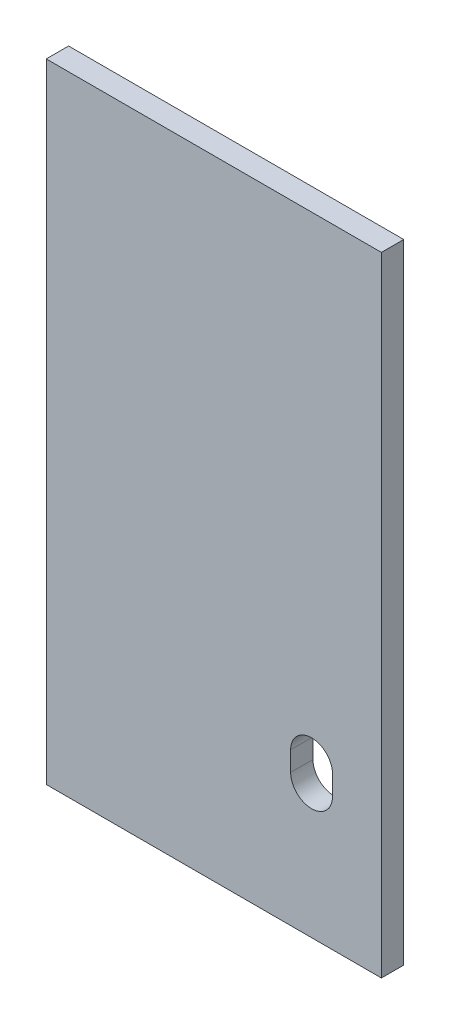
ISO-10303-21;
HEADER;
FILE_DESCRIPTION(('STEP AP214'),'2;1');
FILE_NAME('part.step','',(''),(''),'','','');
FILE_SCHEMA(('AUTOMOTIVE_DESIGN { 1 0 10303 214 1 1 1 1 }'));
ENDSEC;
DATA;
#1=APPLICATION_CONTEXT('core data for automotive mechanical design processes');
#2=APPLICATION_PROTOCOL_DEFINITION('international standard','automotive_design',2000,#1);
#3=PRODUCT_CONTEXT('',#1,'mechanical');
#4=PRODUCT('Part','Part','',(#3));
#5=PRODUCT_RELATED_PRODUCT_CATEGORY('part','',(#4));
#6=PRODUCT_DEFINITION_FORMATION('','',#4);
#7=PRODUCT_DEFINITION_CONTEXT('part definition',#1,'design');
#8=PRODUCT_DEFINITION('design','',#6,#7);
#9=PRODUCT_DEFINITION_SHAPE('','',#8);
#10=(LENGTH_UNIT() NAMED_UNIT(*) SI_UNIT(.MILLI.,.METRE.));
#11=(NAMED_UNIT(*) PLANE_ANGLE_UNIT() SI_UNIT($,.RADIAN.));
#12=(NAMED_UNIT(*) SI_UNIT($,.STERADIAN.) SOLID_ANGLE_UNIT());
#13=UNCERTAINTY_MEASURE_WITH_UNIT(LENGTH_MEASURE(1.E-05),#10,'distance_accuracy_value','');
#14=(GEOMETRIC_REPRESENTATION_CONTEXT(3) GLOBAL_UNCERTAINTY_ASSIGNED_CONTEXT((#13)) GLOBAL_UNIT_ASSIGNED_CONTEXT((#10,
#11,#12)) REPRESENTATION_CONTEXT('',''));
#15=CARTESIAN_POINT('',(0.,0.,0.));
#16=DIRECTION('',(0.,0.,1.));
#17=DIRECTION('',(1.,0.,0.));
#18=AXIS2_PLACEMENT_3D('',#15,#16,#17);
#19=CARTESIAN_POINT('',(0.,225.,8.));
#20=DIRECTION('',(0.,0.,-1.));
#21=DIRECTION('',(-1.,0.,0.));
#22=AXIS2_PLACEMENT_3D('',#19,#20,#21);
#23=PLANE('',#22);
#24=DIRECTION('',(0.,-1.,0.));
#25=VECTOR('',#24,1.);
#26=CARTESIAN_POINT('',(0.,0.,8.));
#27=LINE('',#26,#25);
#28=CARTESIAN_POINT('',(0.,225.,8.));
#29=VERTEX_POINT('',#28);
#30=CARTESIAN_POINT('',(0.,0.,8.));
#31=VERTEX_POINT('',#30);
#32=EDGE_CURVE('E136',#29,#31,#27,.T.);
#33=ORIENTED_EDGE('',*,*,#32,.T.);
#34=DIRECTION('',(1.,0.,0.));
#35=VECTOR('',#34,1.);
#36=CARTESIAN_POINT('',(0.,0.,8.));
#37=LINE('',#36,#35);
#38=CARTESIAN_POINT('',(120.,0.,8.));
#39=VERTEX_POINT('',#38);
#40=EDGE_CURVE('E139',#31,#39,#37,.T.);
#41=ORIENTED_EDGE('',*,*,#40,.T.);
#42=DIRECTION('',(0.,1.,0.));
#43=VECTOR('',#42,1.);
#44=CARTESIAN_POINT('',(120.,0.,8.));
#45=LINE('',#44,#43);
#46=CARTESIAN_POINT('',(120.,225.,8.));
#47=VERTEX_POINT('',#46);
#48=EDGE_CURVE('E142',#39,#47,#45,.T.);
#49=ORIENTED_EDGE('',*,*,#48,.T.);
#50=DIRECTION('',(-1.,0.,0.));
#51=VECTOR('',#50,1.);
#52=CARTESIAN_POINT('',(0.,225.,8.));
#53=LINE('',#52,#51);
#54=EDGE_CURVE('E144',#47,#29,#53,.T.);
#55=ORIENTED_EDGE('',*,*,#54,.T.);
#56=EDGE_LOOP('',(#33,#41,#49,#55));
#57=FACE_BOUND('',#56,.T.);
#58=CARTESIAN_POINT('',(95.,54.5,8.));
#59=DIRECTION('',(0.,0.,1.));
#60=DIRECTION('',(1.,0.,0.));
#61=AXIS2_PLACEMENT_3D('',#58,#59,#60);
#62=CIRCLE('',#61,7.5);
#63=CARTESIAN_POINT('',(102.5,54.5,8.));
#64=VERTEX_POINT('',#63);
#65=CARTESIAN_POINT('',(87.5,54.5,8.));
#66=VERTEX_POINT('',#65);
#67=EDGE_CURVE('E100',#64,#66,#62,.T.);
#68=ORIENTED_EDGE('',*,*,#67,.F.);
#69=DIRECTION('',(0.,1.,0.));
#70=VECTOR('',#69,1.);
#71=CARTESIAN_POINT('',(102.5,54.5,8.));
#72=LINE('',#71,#70);
#73=CARTESIAN_POINT('',(102.5,47.5,8.));
#74=VERTEX_POINT('',#73);
#75=EDGE_CURVE('E122',#74,#64,#72,.T.);
#76=ORIENTED_EDGE('',*,*,#75,.F.);
#77=CARTESIAN_POINT('',(95.,47.5,8.));
#78=DIRECTION('',(0.,0.,1.));
#79=DIRECTION('',(1.,0.,0.));
#80=AXIS2_PLACEMENT_3D('',#77,#78,#79);
#81=CIRCLE('',#80,7.5);
#82=CARTESIAN_POINT('',(87.5,47.5,8.));
#83=VERTEX_POINT('',#82);
#84=EDGE_CURVE('E120',#83,#74,#81,.T.);
#85=ORIENTED_EDGE('',*,*,#84,.F.);
#86=DIRECTION('',(0.,-1.,0.));
#87=VECTOR('',#86,1.);
#88=CARTESIAN_POINT('',(87.5,54.5,8.));
#89=LINE('',#88,#87);
#90=EDGE_CURVE('E108',#66,#83,#89,.T.);
#91=ORIENTED_EDGE('',*,*,#90,.F.);
#92=EDGE_LOOP('',(#68,#76,#85,#91));
#93=FACE_BOUND('',#92,.T.);
#94=ADVANCED_FACE('F35',(#57,#93),#23,.F.);
#95=CARTESIAN_POINT('',(0.,225.,0.));
#96=DIRECTION('',(0.,0.,-1.));
#97=DIRECTION('',(-1.,0.,0.));
#98=AXIS2_PLACEMENT_3D('',#95,#96,#97);
#99=PLANE('',#98);
#100=DIRECTION('',(0.,-1.,0.));
#101=VECTOR('',#100,1.);
#102=CARTESIAN_POINT('',(0.,0.,0.));
#103=LINE('',#102,#101);
#104=CARTESIAN_POINT('',(0.,225.,0.));
#105=VERTEX_POINT('',#104);
#106=CARTESIAN_POINT('',(0.,0.,0.));
#107=VERTEX_POINT('',#106);
#108=EDGE_CURVE('E116',#105,#107,#103,.T.);
#109=ORIENTED_EDGE('',*,*,#108,.F.);
#110=DIRECTION('',(-1.,0.,0.));
#111=VECTOR('',#110,1.);
#112=CARTESIAN_POINT('',(0.,225.,0.));
#113=LINE('',#112,#111);
#114=CARTESIAN_POINT('',(120.,225.,0.));
#115=VERTEX_POINT('',#114);
#116=EDGE_CURVE('E140',#115,#105,#113,.T.);
#117=ORIENTED_EDGE('',*,*,#116,.F.);
#118=DIRECTION('',(0.,1.,0.));
#119=VECTOR('',#118,1.);
#120=CARTESIAN_POINT('',(120.,0.,0.));
#121=LINE('',#120,#119);
#122=CARTESIAN_POINT('',(120.,0.,0.));
#123=VERTEX_POINT('',#122);
#124=EDGE_CURVE('E151',#123,#115,#121,.T.);
#125=ORIENTED_EDGE('',*,*,#124,.F.);
#126=DIRECTION('',(1.,0.,0.));
#127=VECTOR('',#126,1.);
#128=CARTESIAN_POINT('',(0.,0.,0.));
#129=LINE('',#128,#127);
#130=EDGE_CURVE('E149',#107,#123,#129,.T.);
#131=ORIENTED_EDGE('',*,*,#130,.F.);
#132=EDGE_LOOP('',(#109,#117,#125,#131));
#133=FACE_BOUND('',#132,.T.);
#134=DIRECTION('',(0.,1.,0.));
#135=VECTOR('',#134,1.);
#136=CARTESIAN_POINT('',(102.5,54.5,0.));
#137=LINE('',#136,#135);
#138=CARTESIAN_POINT('',(102.5,47.5,0.));
#139=VERTEX_POINT('',#138);
#140=CARTESIAN_POINT('',(102.5,54.5,0.));
#141=VERTEX_POINT('',#140);
#142=EDGE_CURVE('E109',#139,#141,#137,.T.);
#143=ORIENTED_EDGE('',*,*,#142,.T.);
#144=CARTESIAN_POINT('',(95.,54.5,0.));
#145=DIRECTION('',(0.,0.,1.));
#146=DIRECTION('',(1.,0.,0.));
#147=AXIS2_PLACEMENT_3D('',#144,#145,#146);
#148=CIRCLE('',#147,7.5);
#149=CARTESIAN_POINT('',(87.5,54.5,0.));
#150=VERTEX_POINT('',#149);
#151=EDGE_CURVE('E58',#141,#150,#148,.T.);
#152=ORIENTED_EDGE('',*,*,#151,.T.);
#153=DIRECTION('',(0.,-1.,0.));
#154=VECTOR('',#153,1.);
#155=CARTESIAN_POINT('',(87.5,54.5,0.));
#156=LINE('',#155,#154);
#157=CARTESIAN_POINT('',(87.5,47.5,0.));
#158=VERTEX_POINT('',#157);
#159=EDGE_CURVE('E115',#150,#158,#156,.T.);
#160=ORIENTED_EDGE('',*,*,#159,.T.);
#161=CARTESIAN_POINT('',(95.,47.5,0.));
#162=DIRECTION('',(0.,0.,1.));
#163=DIRECTION('',(1.,0.,0.));
#164=AXIS2_PLACEMENT_3D('',#161,#162,#163);
#165=CIRCLE('',#164,7.5);
#166=EDGE_CURVE('E128',#158,#139,#165,.T.);
#167=ORIENTED_EDGE('',*,*,#166,.T.);
#168=EDGE_LOOP('',(#143,#152,#160,#167));
#169=FACE_BOUND('',#168,.T.);
#170=ADVANCED_FACE('F169',(#133,#169),#99,.T.);
#171=CARTESIAN_POINT('',(0.,0.,8.));
#172=DIRECTION('',(1.,0.,0.));
#173=DIRECTION('',(0.,0.,-1.));
#174=AXIS2_PLACEMENT_3D('',#171,#172,#173);
#175=PLANE('',#174);
#176=ORIENTED_EDGE('',*,*,#108,.T.);
#177=DIRECTION('',(0.,0.,-1.));
#178=VECTOR('',#177,1.);
#179=CARTESIAN_POINT('',(0.,0.,8.));
#180=LINE('',#179,#178);
#181=EDGE_CURVE('E11',#31,#107,#180,.T.);
#182=ORIENTED_EDGE('',*,*,#181,.F.);
#183=ORIENTED_EDGE('',*,*,#32,.F.);
#184=DIRECTION('',(0.,0.,-1.));
#185=VECTOR('',#184,1.);
#186=CARTESIAN_POINT('',(0.,225.,8.));
#187=LINE('',#186,#185);
#188=EDGE_CURVE('E146',#29,#105,#187,.T.);
#189=ORIENTED_EDGE('',*,*,#188,.T.);
#190=EDGE_LOOP('',(#176,#182,#183,#189));
#191=FACE_BOUND('',#190,.T.);
#192=ADVANCED_FACE('F37',(#191),#175,.F.);
#193=CARTESIAN_POINT('',(0.,0.,8.));
#194=DIRECTION('',(0.,1.,0.));
#195=DIRECTION('',(0.,0.,1.));
#196=AXIS2_PLACEMENT_3D('',#193,#194,#195);
#197=PLANE('',#196);
#198=ORIENTED_EDGE('',*,*,#130,.T.);
#199=DIRECTION('',(0.,0.,-1.));
#200=VECTOR('',#199,1.);
#201=CARTESIAN_POINT('',(120.,0.,8.));
#202=LINE('',#201,#200);
#203=EDGE_CURVE('E43',#39,#123,#202,.T.);
#204=ORIENTED_EDGE('',*,*,#203,.F.);
#205=ORIENTED_EDGE('',*,*,#40,.F.);
#206=ORIENTED_EDGE('',*,*,#181,.T.);
#207=EDGE_LOOP('',(#198,#204,#205,#206));
#208=FACE_BOUND('',#207,.T.);
#209=ADVANCED_FACE('F179',(#208),#197,.F.);
#210=CARTESIAN_POINT('',(120.,0.,8.));
#211=DIRECTION('',(-1.,0.,0.));
#212=DIRECTION('',(0.,0.,1.));
#213=AXIS2_PLACEMENT_3D('',#210,#211,#212);
#214=PLANE('',#213);
#215=ORIENTED_EDGE('',*,*,#124,.T.);
#216=DIRECTION('',(0.,0.,-1.));
#217=VECTOR('',#216,1.);
#218=CARTESIAN_POINT('',(120.,225.,8.));
#219=LINE('',#218,#217);
#220=EDGE_CURVE('E156',#47,#115,#219,.T.);
#221=ORIENTED_EDGE('',*,*,#220,.F.);
#222=ORIENTED_EDGE('',*,*,#48,.F.);
#223=ORIENTED_EDGE('',*,*,#203,.T.);
#224=EDGE_LOOP('',(#215,#221,#222,#223));
#225=FACE_BOUND('',#224,.T.);
#226=ADVANCED_FACE('F163',(#225),#214,.F.);
#227=CARTESIAN_POINT('',(0.,225.,8.));
#228=DIRECTION('',(0.,-1.,0.));
#229=DIRECTION('',(0.,0.,-1.));
#230=AXIS2_PLACEMENT_3D('',#227,#228,#229);
#231=PLANE('',#230);
#232=ORIENTED_EDGE('',*,*,#116,.T.);
#233=ORIENTED_EDGE('',*,*,#188,.F.);
#234=ORIENTED_EDGE('',*,*,#54,.F.);
#235=ORIENTED_EDGE('',*,*,#220,.T.);
#236=EDGE_LOOP('',(#232,#233,#234,#235));
#237=FACE_BOUND('',#236,.T.);
#238=ADVANCED_FACE('F173',(#237),#231,.F.);
#239=CARTESIAN_POINT('',(95.,54.5,8.));
#240=DIRECTION('',(0.,0.,-1.));
#241=DIRECTION('',(-1.,0.,0.));
#242=AXIS2_PLACEMENT_3D('',#239,#240,#241);
#243=CYLINDRICAL_SURFACE('',#242,7.5);
#244=ORIENTED_EDGE('',*,*,#151,.F.);
#245=DIRECTION('',(0.,0.,-1.));
#246=VECTOR('',#245,1.);
#247=CARTESIAN_POINT('',(102.5,54.5,8.));
#248=LINE('',#247,#246);
#249=EDGE_CURVE('E104',#64,#141,#248,.T.);
#250=ORIENTED_EDGE('',*,*,#249,.F.);
#251=ORIENTED_EDGE('',*,*,#67,.T.);
#252=DIRECTION('',(0.,0.,-1.));
#253=VECTOR('',#252,1.);
#254=CARTESIAN_POINT('',(87.5,54.5,8.));
#255=LINE('',#254,#253);
#256=EDGE_CURVE('E103',#66,#150,#255,.T.);
#257=ORIENTED_EDGE('',*,*,#256,.T.);
#258=EDGE_LOOP('',(#244,#250,#251,#257));
#259=FACE_BOUND('',#258,.T.);
#260=ADVANCED_FACE('F102',(#259),#243,.F.);
#261=CARTESIAN_POINT('',(87.5,54.5,8.));
#262=DIRECTION('',(1.,0.,0.));
#263=DIRECTION('',(0.,0.,-1.));
#264=AXIS2_PLACEMENT_3D('',#261,#262,#263);
#265=PLANE('',#264);
#266=ORIENTED_EDGE('',*,*,#159,.F.);
#267=ORIENTED_EDGE('',*,*,#256,.F.);
#268=ORIENTED_EDGE('',*,*,#90,.T.);
#269=DIRECTION('',(0.,0.,-1.));
#270=VECTOR('',#269,1.);
#271=CARTESIAN_POINT('',(87.5,47.5,8.));
#272=LINE('',#271,#270);
#273=EDGE_CURVE('E117',#83,#158,#272,.T.);
#274=ORIENTED_EDGE('',*,*,#273,.T.);
#275=EDGE_LOOP('',(#266,#267,#268,#274));
#276=FACE_BOUND('',#275,.T.);
#277=ADVANCED_FACE('F112',(#276),#265,.T.);
#278=CARTESIAN_POINT('',(95.,47.5,8.));
#279=DIRECTION('',(0.,0.,-1.));
#280=DIRECTION('',(-1.,0.,0.));
#281=AXIS2_PLACEMENT_3D('',#278,#279,#280);
#282=CYLINDRICAL_SURFACE('',#281,7.5);
#283=ORIENTED_EDGE('',*,*,#166,.F.);
#284=ORIENTED_EDGE('',*,*,#273,.F.);
#285=ORIENTED_EDGE('',*,*,#84,.T.);
#286=DIRECTION('',(0.,0.,-1.));
#287=VECTOR('',#286,1.);
#288=CARTESIAN_POINT('',(102.5,47.5,8.));
#289=LINE('',#288,#287);
#290=EDGE_CURVE('E50',#74,#139,#289,.T.);
#291=ORIENTED_EDGE('',*,*,#290,.T.);
#292=EDGE_LOOP('',(#283,#284,#285,#291));
#293=FACE_BOUND('',#292,.T.);
#294=ADVANCED_FACE('F202',(#293),#282,.F.);
#295=CARTESIAN_POINT('',(102.5,54.5,8.));
#296=DIRECTION('',(-1.,0.,0.));
#297=DIRECTION('',(0.,0.,1.));
#298=AXIS2_PLACEMENT_3D('',#295,#296,#297);
#299=PLANE('',#298);
#300=ORIENTED_EDGE('',*,*,#142,.F.);
#301=ORIENTED_EDGE('',*,*,#290,.F.);
#302=ORIENTED_EDGE('',*,*,#75,.T.);
#303=ORIENTED_EDGE('',*,*,#249,.T.);
#304=EDGE_LOOP('',(#300,#301,#302,#303));
#305=FACE_BOUND('',#304,.T.);
#306=ADVANCED_FACE('F206',(#305),#299,.T.);
#307=CLOSED_SHELL('',(#94,#170,#192,#209,#226,#238,#260,#277,#294,#306));
#308=MANIFOLD_SOLID_BREP('B2',#307);
#309=ADVANCED_BREP_SHAPE_REPRESENTATION('',(#18,#308),#14);
#310=SHAPE_DEFINITION_REPRESENTATION(#9,#309);
ENDSEC;
END-ISO-10303-21;
